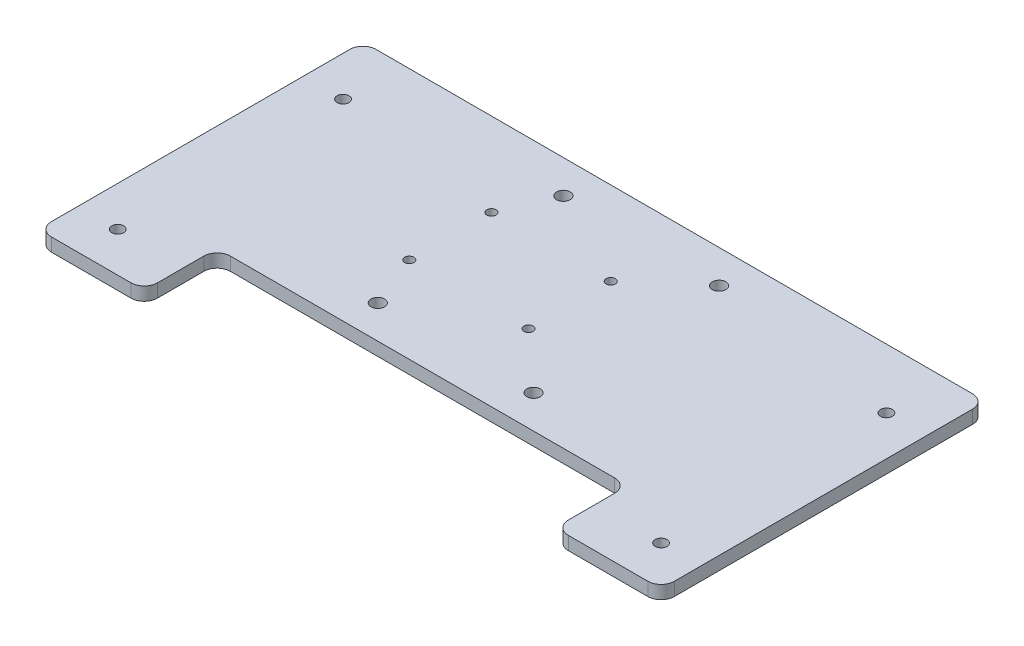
ISO-10303-21;
HEADER;
FILE_DESCRIPTION(('STEP AP214'),'2;1');
FILE_NAME('part.step','',(''),(''),'','','');
FILE_SCHEMA(('AUTOMOTIVE_DESIGN { 1 0 10303 214 1 1 1 1 }'));
ENDSEC;
DATA;
#1=APPLICATION_CONTEXT('core data for automotive mechanical design processes');
#2=APPLICATION_PROTOCOL_DEFINITION('international standard','automotive_design',2000,#1);
#3=PRODUCT_CONTEXT('',#1,'mechanical');
#4=PRODUCT('Part','Part','',(#3));
#5=PRODUCT_RELATED_PRODUCT_CATEGORY('part','',(#4));
#6=PRODUCT_DEFINITION_FORMATION('','',#4);
#7=PRODUCT_DEFINITION_CONTEXT('part definition',#1,'design');
#8=PRODUCT_DEFINITION('design','',#6,#7);
#9=PRODUCT_DEFINITION_SHAPE('','',#8);
#10=(LENGTH_UNIT() NAMED_UNIT(*) SI_UNIT(.MILLI.,.METRE.));
#11=(NAMED_UNIT(*) PLANE_ANGLE_UNIT() SI_UNIT($,.RADIAN.));
#12=(NAMED_UNIT(*) SI_UNIT($,.STERADIAN.) SOLID_ANGLE_UNIT());
#13=UNCERTAINTY_MEASURE_WITH_UNIT(LENGTH_MEASURE(1.E-05),#10,'distance_accuracy_value','');
#14=(GEOMETRIC_REPRESENTATION_CONTEXT(3) GLOBAL_UNCERTAINTY_ASSIGNED_CONTEXT((#13)) GLOBAL_UNIT_ASSIGNED_CONTEXT((#10,
#11,#12)) REPRESENTATION_CONTEXT('',''));
#15=CARTESIAN_POINT('',(0.,0.,0.));
#16=DIRECTION('',(0.,0.,1.));
#17=DIRECTION('',(1.,0.,0.));
#18=AXIS2_PLACEMENT_3D('',#15,#16,#17);
#19=CARTESIAN_POINT('',(145.,10.,-45.));
#20=DIRECTION('',(0.,1.,0.));
#21=DIRECTION('',(0.,0.,1.));
#22=AXIS2_PLACEMENT_3D('',#19,#20,#21);
#23=PLANE('',#22);
#24=CARTESIAN_POINT('',(58.75,10.,-220.));
#25=DIRECTION('',(0.,1.,0.));
#26=DIRECTION('',(0.,0.,1.));
#27=AXIS2_PLACEMENT_3D('',#24,#25,#26);
#28=CIRCLE('',#27,5.12500000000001);
#29=CARTESIAN_POINT('',(58.75,10.,-214.875));
#30=VERTEX_POINT('',#29);
#31=EDGE_CURVE('E403',#30,#30,#28,.T.);
#32=ORIENTED_EDGE('',*,*,#31,.F.);
#33=EDGE_LOOP('',(#32));
#34=FACE_BOUND('',#33,.T.);
#35=CARTESIAN_POINT('',(-58.75,10.,-220.));
#36=DIRECTION('',(0.,1.,0.));
#37=DIRECTION('',(0.,0.,1.));
#38=AXIS2_PLACEMENT_3D('',#35,#36,#37);
#39=CIRCLE('',#38,5.12500000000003);
#40=CARTESIAN_POINT('',(-58.75,10.,-214.875));
#41=VERTEX_POINT('',#40);
#42=EDGE_CURVE('E405',#41,#41,#39,.T.);
#43=ORIENTED_EDGE('',*,*,#42,.F.);
#44=EDGE_LOOP('',(#43));
#45=FACE_BOUND('',#44,.T.);
#46=CARTESIAN_POINT('',(58.75,10.,-80.));
#47=DIRECTION('',(0.,1.,0.));
#48=DIRECTION('',(0.,0.,1.));
#49=AXIS2_PLACEMENT_3D('',#46,#47,#48);
#50=CIRCLE('',#49,5.12500000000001);
#51=CARTESIAN_POINT('',(58.75,10.,-74.875));
#52=VERTEX_POINT('',#51);
#53=EDGE_CURVE('E413',#52,#52,#50,.T.);
#54=ORIENTED_EDGE('',*,*,#53,.F.);
#55=EDGE_LOOP('',(#54));
#56=FACE_BOUND('',#55,.T.);
#57=CARTESIAN_POINT('',(-58.75,10.,-80.));
#58=DIRECTION('',(0.,1.,0.));
#59=DIRECTION('',(0.,0.,1.));
#60=AXIS2_PLACEMENT_3D('',#57,#58,#59);
#61=CIRCLE('',#60,5.125);
#62=CARTESIAN_POINT('',(-58.75,10.,-74.875));
#63=VERTEX_POINT('',#62);
#64=EDGE_CURVE('E419',#63,#63,#61,.T.);
#65=ORIENTED_EDGE('',*,*,#64,.F.);
#66=EDGE_LOOP('',(#65));
#67=FACE_BOUND('',#66,.T.);
#68=CARTESIAN_POINT('',(15.,10.,-182.));
#69=DIRECTION('',(0.,1.,0.));
#70=DIRECTION('',(0.,0.,1.));
#71=AXIS2_PLACEMENT_3D('',#68,#69,#70);
#72=CIRCLE('',#71,3.5);
#73=CARTESIAN_POINT('',(15.,10.,-178.5));
#74=VERTEX_POINT('',#73);
#75=EDGE_CURVE('E434',#74,#74,#72,.T.);
#76=ORIENTED_EDGE('',*,*,#75,.F.);
#77=EDGE_LOOP('',(#76));
#78=FACE_BOUND('',#77,.T.);
#79=CARTESIAN_POINT('',(-75.,10.,-182.));
#80=DIRECTION('',(0.,1.,0.));
#81=DIRECTION('',(0.,0.,1.));
#82=AXIS2_PLACEMENT_3D('',#79,#80,#81);
#83=CIRCLE('',#82,3.50000000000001);
#84=CARTESIAN_POINT('',(-75.,10.,-178.5));
#85=VERTEX_POINT('',#84);
#86=EDGE_CURVE('E446',#85,#85,#83,.T.);
#87=ORIENTED_EDGE('',*,*,#86,.F.);
#88=EDGE_LOOP('',(#87));
#89=FACE_BOUND('',#88,.T.);
#90=CARTESIAN_POINT('',(-205.,10.,-30.));
#91=DIRECTION('',(0.,1.,0.));
#92=DIRECTION('',(0.,0.,-1.));
#93=AXIS2_PLACEMENT_3D('',#90,#91,#92);
#94=CIRCLE('',#93,4.49999999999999);
#95=CARTESIAN_POINT('',(-205.,10.,-34.5));
#96=VERTEX_POINT('',#95);
#97=EDGE_CURVE('E458',#96,#96,#94,.T.);
#98=ORIENTED_EDGE('',*,*,#97,.F.);
#99=EDGE_LOOP('',(#98));
#100=FACE_BOUND('',#99,.T.);
#101=CARTESIAN_POINT('',(205.,10.,-200.));
#102=DIRECTION('',(0.,1.,0.));
#103=DIRECTION('',(0.,0.,1.));
#104=AXIS2_PLACEMENT_3D('',#101,#102,#103);
#105=CIRCLE('',#104,4.49999999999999);
#106=CARTESIAN_POINT('',(205.,10.,-195.5));
#107=VERTEX_POINT('',#106);
#108=EDGE_CURVE('E166',#107,#107,#105,.T.);
#109=ORIENTED_EDGE('',*,*,#108,.F.);
#110=EDGE_LOOP('',(#109));
#111=FACE_BOUND('',#110,.T.);
#112=CARTESIAN_POINT('',(145.,10.,-45.));
#113=DIRECTION('',(0.,-1.,0.));
#114=DIRECTION('',(0.,0.,1.));
#115=AXIS2_PLACEMENT_3D('',#112,#113,#114);
#116=CIRCLE('',#115,10.);
#117=CARTESIAN_POINT('',(145.,10.,-55.));
#118=VERTEX_POINT('',#117);
#119=CARTESIAN_POINT('',(155.,10.,-44.9999999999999));
#120=VERTEX_POINT('',#119);
#121=EDGE_CURVE('E200',#118,#120,#116,.T.);
#122=ORIENTED_EDGE('',*,*,#121,.T.);
#123=DIRECTION('',(0.,0.,1.));
#124=VECTOR('',#123,1.);
#125=CARTESIAN_POINT('',(155.,10.,-44.9999999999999));
#126=LINE('',#125,#124);
#127=CARTESIAN_POINT('',(155.,10.,-10.0000000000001));
#128=VERTEX_POINT('',#127);
#129=EDGE_CURVE('E161',#120,#128,#126,.T.);
#130=ORIENTED_EDGE('',*,*,#129,.T.);
#131=CARTESIAN_POINT('',(165.,10.,-10.));
#132=DIRECTION('',(0.,1.,0.));
#133=DIRECTION('',(0.,0.,-1.));
#134=AXIS2_PLACEMENT_3D('',#131,#132,#133);
#135=CIRCLE('',#134,10.);
#136=CARTESIAN_POINT('',(165.,10.,0.));
#137=VERTEX_POINT('',#136);
#138=EDGE_CURVE('E203',#128,#137,#135,.T.);
#139=ORIENTED_EDGE('',*,*,#138,.T.);
#140=DIRECTION('',(1.,0.,0.));
#141=VECTOR('',#140,1.);
#142=CARTESIAN_POINT('',(165.,10.,0.));
#143=LINE('',#142,#141);
#144=CARTESIAN_POINT('',(225.,10.,0.));
#145=VERTEX_POINT('',#144);
#146=EDGE_CURVE('E205',#137,#145,#143,.T.);
#147=ORIENTED_EDGE('',*,*,#146,.T.);
#148=CARTESIAN_POINT('',(225.,10.,-10.));
#149=DIRECTION('',(0.,1.,0.));
#150=DIRECTION('',(0.,0.,-1.));
#151=AXIS2_PLACEMENT_3D('',#148,#149,#150);
#152=CIRCLE('',#151,10.);
#153=CARTESIAN_POINT('',(235.,10.,-10.0000000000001));
#154=VERTEX_POINT('',#153);
#155=EDGE_CURVE('E207',#145,#154,#152,.T.);
#156=ORIENTED_EDGE('',*,*,#155,.T.);
#157=DIRECTION('',(0.,0.,-1.));
#158=VECTOR('',#157,1.);
#159=CARTESIAN_POINT('',(235.,10.,-10.0000000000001));
#160=LINE('',#159,#158);
#161=CARTESIAN_POINT('',(235.,10.,-235.));
#162=VERTEX_POINT('',#161);
#163=EDGE_CURVE('E209',#154,#162,#160,.T.);
#164=ORIENTED_EDGE('',*,*,#163,.T.);
#165=CARTESIAN_POINT('',(225.,10.,-235.));
#166=DIRECTION('',(0.,1.,0.));
#167=DIRECTION('',(0.,0.,-1.));
#168=AXIS2_PLACEMENT_3D('',#165,#166,#167);
#169=CIRCLE('',#168,10.);
#170=CARTESIAN_POINT('',(225.,10.,-245.));
#171=VERTEX_POINT('',#170);
#172=EDGE_CURVE('E211',#162,#171,#169,.T.);
#173=ORIENTED_EDGE('',*,*,#172,.T.);
#174=DIRECTION('',(-1.,0.,0.));
#175=VECTOR('',#174,1.);
#176=CARTESIAN_POINT('',(-225.,10.,-245.));
#177=LINE('',#176,#175);
#178=CARTESIAN_POINT('',(-225.,10.,-245.));
#179=VERTEX_POINT('',#178);
#180=EDGE_CURVE('E213',#171,#179,#177,.T.);
#181=ORIENTED_EDGE('',*,*,#180,.T.);
#182=CARTESIAN_POINT('',(-225.,10.,-235.));
#183=DIRECTION('',(0.,1.,0.));
#184=DIRECTION('',(0.,0.,1.));
#185=AXIS2_PLACEMENT_3D('',#182,#183,#184);
#186=CIRCLE('',#185,10.);
#187=CARTESIAN_POINT('',(-235.,10.,-235.));
#188=VERTEX_POINT('',#187);
#189=EDGE_CURVE('E215',#179,#188,#186,.T.);
#190=ORIENTED_EDGE('',*,*,#189,.T.);
#191=DIRECTION('',(0.,0.,1.));
#192=VECTOR('',#191,1.);
#193=CARTESIAN_POINT('',(-235.,10.,-10.0000000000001));
#194=LINE('',#193,#192);
#195=CARTESIAN_POINT('',(-235.,10.,-10.0000000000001));
#196=VERTEX_POINT('',#195);
#197=EDGE_CURVE('E217',#188,#196,#194,.T.);
#198=ORIENTED_EDGE('',*,*,#197,.T.);
#199=CARTESIAN_POINT('',(-225.,10.,-10.));
#200=DIRECTION('',(0.,1.,0.));
#201=DIRECTION('',(0.,0.,1.));
#202=AXIS2_PLACEMENT_3D('',#199,#200,#201);
#203=CIRCLE('',#202,10.);
#204=CARTESIAN_POINT('',(-225.,10.,0.));
#205=VERTEX_POINT('',#204);
#206=EDGE_CURVE('E219',#196,#205,#203,.T.);
#207=ORIENTED_EDGE('',*,*,#206,.T.);
#208=DIRECTION('',(1.,0.,0.));
#209=VECTOR('',#208,1.);
#210=CARTESIAN_POINT('',(-165.,10.,0.));
#211=LINE('',#210,#209);
#212=CARTESIAN_POINT('',(-165.,10.,0.));
#213=VERTEX_POINT('',#212);
#214=EDGE_CURVE('E221',#205,#213,#211,.T.);
#215=ORIENTED_EDGE('',*,*,#214,.T.);
#216=CARTESIAN_POINT('',(-165.,10.,-10.));
#217=DIRECTION('',(0.,1.,0.));
#218=DIRECTION('',(0.,0.,1.));
#219=AXIS2_PLACEMENT_3D('',#216,#217,#218);
#220=CIRCLE('',#219,10.);
#221=CARTESIAN_POINT('',(-155.,10.,-10.0000000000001));
#222=VERTEX_POINT('',#221);
#223=EDGE_CURVE('E223',#213,#222,#220,.T.);
#224=ORIENTED_EDGE('',*,*,#223,.T.);
#225=DIRECTION('',(0.,0.,-1.));
#226=VECTOR('',#225,1.);
#227=CARTESIAN_POINT('',(-155.,10.,-44.9999999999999));
#228=LINE('',#227,#226);
#229=CARTESIAN_POINT('',(-155.,10.,-44.9999999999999));
#230=VERTEX_POINT('',#229);
#231=EDGE_CURVE('E225',#222,#230,#228,.T.);
#232=ORIENTED_EDGE('',*,*,#231,.T.);
#233=CARTESIAN_POINT('',(-145.,10.,-45.));
#234=DIRECTION('',(0.,-1.,0.));
#235=DIRECTION('',(0.,0.,-1.));
#236=AXIS2_PLACEMENT_3D('',#233,#234,#235);
#237=CIRCLE('',#236,10.);
#238=CARTESIAN_POINT('',(-145.,10.,-55.));
#239=VERTEX_POINT('',#238);
#240=EDGE_CURVE('E54',#230,#239,#237,.T.);
#241=ORIENTED_EDGE('',*,*,#240,.T.);
#242=DIRECTION('',(1.,0.,0.));
#243=VECTOR('',#242,1.);
#244=CARTESIAN_POINT('',(-145.,10.,-55.));
#245=LINE('',#244,#243);
#246=EDGE_CURVE('E49',#239,#118,#245,.T.);
#247=ORIENTED_EDGE('',*,*,#246,.T.);
#248=EDGE_LOOP('',(#122,#130,#139,#147,#156,#164,#173,#181,#190,#198,#207,#215,#224,#232,#241,#247));
#249=FACE_BOUND('',#248,.T.);
#250=CARTESIAN_POINT('',(205.,10.,-30.));
#251=DIRECTION('',(0.,1.,0.));
#252=DIRECTION('',(0.,0.,1.));
#253=AXIS2_PLACEMENT_3D('',#250,#251,#252);
#254=CIRCLE('',#253,4.49999999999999);
#255=CARTESIAN_POINT('',(205.,10.,-25.5));
#256=VERTEX_POINT('',#255);
#257=EDGE_CURVE('E464',#256,#256,#254,.T.);
#258=ORIENTED_EDGE('',*,*,#257,.F.);
#259=EDGE_LOOP('',(#258));
#260=FACE_BOUND('',#259,.T.);
#261=CARTESIAN_POINT('',(-205.,10.,-200.));
#262=DIRECTION('',(0.,1.,0.));
#263=DIRECTION('',(0.,0.,-1.));
#264=AXIS2_PLACEMENT_3D('',#261,#262,#263);
#265=CIRCLE('',#264,4.49999999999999);
#266=CARTESIAN_POINT('',(-205.,10.,-204.5));
#267=VERTEX_POINT('',#266);
#268=EDGE_CURVE('E452',#267,#267,#265,.T.);
#269=ORIENTED_EDGE('',*,*,#268,.F.);
#270=EDGE_LOOP('',(#269));
#271=FACE_BOUND('',#270,.T.);
#272=CARTESIAN_POINT('',(-75.,10.,-120.));
#273=DIRECTION('',(0.,1.,0.));
#274=DIRECTION('',(0.,0.,1.));
#275=AXIS2_PLACEMENT_3D('',#272,#273,#274);
#276=CIRCLE('',#275,3.50000000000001);
#277=CARTESIAN_POINT('',(-75.,10.,-116.5));
#278=VERTEX_POINT('',#277);
#279=EDGE_CURVE('E440',#278,#278,#276,.T.);
#280=ORIENTED_EDGE('',*,*,#279,.F.);
#281=EDGE_LOOP('',(#280));
#282=FACE_BOUND('',#281,.T.);
#283=CARTESIAN_POINT('',(15.,10.,-120.));
#284=DIRECTION('',(0.,1.,0.));
#285=DIRECTION('',(0.,0.,1.));
#286=AXIS2_PLACEMENT_3D('',#283,#284,#285);
#287=CIRCLE('',#286,3.5);
#288=CARTESIAN_POINT('',(15.,10.,-116.5));
#289=VERTEX_POINT('',#288);
#290=EDGE_CURVE('E428',#289,#289,#287,.T.);
#291=ORIENTED_EDGE('',*,*,#290,.F.);
#292=EDGE_LOOP('',(#291));
#293=FACE_BOUND('',#292,.T.);
#294=ADVANCED_FACE('F34',(#34,#45,#56,#67,#78,#89,#100,#111,#249,#260,#271,#282,#293),#23,.T.);
#295=CARTESIAN_POINT('',(145.,0.,-45.));
#296=DIRECTION('',(0.,1.,0.));
#297=DIRECTION('',(0.,0.,1.));
#298=AXIS2_PLACEMENT_3D('',#295,#296,#297);
#299=PLANE('',#298);
#300=CARTESIAN_POINT('',(58.75,0.,-220.));
#301=DIRECTION('',(0.,1.,0.));
#302=DIRECTION('',(0.,0.,1.));
#303=AXIS2_PLACEMENT_3D('',#300,#301,#302);
#304=CIRCLE('',#303,5.12500000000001);
#305=CARTESIAN_POINT('',(58.75,0.,-214.875));
#306=VERTEX_POINT('',#305);
#307=EDGE_CURVE('E401',#306,#306,#304,.T.);
#308=ORIENTED_EDGE('',*,*,#307,.T.);
#309=EDGE_LOOP('',(#308));
#310=FACE_BOUND('',#309,.T.);
#311=CARTESIAN_POINT('',(-58.75,0.,-220.));
#312=DIRECTION('',(0.,1.,0.));
#313=DIRECTION('',(0.,0.,1.));
#314=AXIS2_PLACEMENT_3D('',#311,#312,#313);
#315=CIRCLE('',#314,5.12500000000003);
#316=CARTESIAN_POINT('',(-58.75,0.,-214.875));
#317=VERTEX_POINT('',#316);
#318=EDGE_CURVE('E410',#317,#317,#315,.T.);
#319=ORIENTED_EDGE('',*,*,#318,.T.);
#320=EDGE_LOOP('',(#319));
#321=FACE_BOUND('',#320,.T.);
#322=CARTESIAN_POINT('',(58.75,0.,-80.));
#323=DIRECTION('',(0.,1.,0.));
#324=DIRECTION('',(0.,0.,1.));
#325=AXIS2_PLACEMENT_3D('',#322,#323,#324);
#326=CIRCLE('',#325,5.12500000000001);
#327=CARTESIAN_POINT('',(58.75,0.,-74.875));
#328=VERTEX_POINT('',#327);
#329=EDGE_CURVE('E416',#328,#328,#326,.T.);
#330=ORIENTED_EDGE('',*,*,#329,.T.);
#331=EDGE_LOOP('',(#330));
#332=FACE_BOUND('',#331,.T.);
#333=CARTESIAN_POINT('',(-58.75,0.,-80.));
#334=DIRECTION('',(0.,1.,0.));
#335=DIRECTION('',(0.,0.,1.));
#336=AXIS2_PLACEMENT_3D('',#333,#334,#335);
#337=CIRCLE('',#336,5.125);
#338=CARTESIAN_POINT('',(-58.75,0.,-74.875));
#339=VERTEX_POINT('',#338);
#340=EDGE_CURVE('E422',#339,#339,#337,.T.);
#341=ORIENTED_EDGE('',*,*,#340,.T.);
#342=EDGE_LOOP('',(#341));
#343=FACE_BOUND('',#342,.T.);
#344=CARTESIAN_POINT('',(15.,0.,-182.));
#345=DIRECTION('',(0.,1.,0.));
#346=DIRECTION('',(0.,0.,1.));
#347=AXIS2_PLACEMENT_3D('',#344,#345,#346);
#348=CIRCLE('',#347,3.5);
#349=CARTESIAN_POINT('',(15.,0.,-178.5));
#350=VERTEX_POINT('',#349);
#351=EDGE_CURVE('E431',#350,#350,#348,.T.);
#352=ORIENTED_EDGE('',*,*,#351,.T.);
#353=EDGE_LOOP('',(#352));
#354=FACE_BOUND('',#353,.T.);
#355=CARTESIAN_POINT('',(-75.,0.,-182.));
#356=DIRECTION('',(0.,1.,0.));
#357=DIRECTION('',(0.,0.,1.));
#358=AXIS2_PLACEMENT_3D('',#355,#356,#357);
#359=CIRCLE('',#358,3.50000000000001);
#360=CARTESIAN_POINT('',(-75.,0.,-178.5));
#361=VERTEX_POINT('',#360);
#362=EDGE_CURVE('E443',#361,#361,#359,.T.);
#363=ORIENTED_EDGE('',*,*,#362,.T.);
#364=EDGE_LOOP('',(#363));
#365=FACE_BOUND('',#364,.T.);
#366=CARTESIAN_POINT('',(-205.,0.,-30.));
#367=DIRECTION('',(0.,1.,0.));
#368=DIRECTION('',(0.,0.,-1.));
#369=AXIS2_PLACEMENT_3D('',#366,#367,#368);
#370=CIRCLE('',#369,4.49999999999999);
#371=CARTESIAN_POINT('',(-205.,0.,-34.5));
#372=VERTEX_POINT('',#371);
#373=EDGE_CURVE('E455',#372,#372,#370,.T.);
#374=ORIENTED_EDGE('',*,*,#373,.T.);
#375=EDGE_LOOP('',(#374));
#376=FACE_BOUND('',#375,.T.);
#377=CARTESIAN_POINT('',(205.,0.,-200.));
#378=DIRECTION('',(0.,1.,0.));
#379=DIRECTION('',(0.,0.,1.));
#380=AXIS2_PLACEMENT_3D('',#377,#378,#379);
#381=CIRCLE('',#380,4.49999999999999);
#382=CARTESIAN_POINT('',(205.,0.,-195.5));
#383=VERTEX_POINT('',#382);
#384=EDGE_CURVE('E169',#383,#383,#381,.T.);
#385=ORIENTED_EDGE('',*,*,#384,.T.);
#386=EDGE_LOOP('',(#385));
#387=FACE_BOUND('',#386,.T.);
#388=CARTESIAN_POINT('',(145.,0.,-45.));
#389=DIRECTION('',(0.,-1.,0.));
#390=DIRECTION('',(0.,0.,1.));
#391=AXIS2_PLACEMENT_3D('',#388,#389,#390);
#392=CIRCLE('',#391,10.);
#393=CARTESIAN_POINT('',(145.,0.,-55.));
#394=VERTEX_POINT('',#393);
#395=CARTESIAN_POINT('',(155.,0.,-44.9999999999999));
#396=VERTEX_POINT('',#395);
#397=EDGE_CURVE('E152',#394,#396,#392,.T.);
#398=ORIENTED_EDGE('',*,*,#397,.F.);
#399=DIRECTION('',(1.,0.,0.));
#400=VECTOR('',#399,1.);
#401=CARTESIAN_POINT('',(-145.,0.,-55.));
#402=LINE('',#401,#400);
#403=CARTESIAN_POINT('',(-145.,0.,-55.));
#404=VERTEX_POINT('',#403);
#405=EDGE_CURVE('E198',#404,#394,#402,.T.);
#406=ORIENTED_EDGE('',*,*,#405,.F.);
#407=CARTESIAN_POINT('',(-145.,0.,-45.));
#408=DIRECTION('',(0.,-1.,0.));
#409=DIRECTION('',(0.,0.,-1.));
#410=AXIS2_PLACEMENT_3D('',#407,#408,#409);
#411=CIRCLE('',#410,10.);
#412=CARTESIAN_POINT('',(-155.,0.,-44.9999999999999));
#413=VERTEX_POINT('',#412);
#414=EDGE_CURVE('E196',#413,#404,#411,.T.);
#415=ORIENTED_EDGE('',*,*,#414,.F.);
#416=DIRECTION('',(0.,0.,-1.));
#417=VECTOR('',#416,1.);
#418=CARTESIAN_POINT('',(-155.,0.,-44.9999999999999));
#419=LINE('',#418,#417);
#420=CARTESIAN_POINT('',(-155.,0.,-10.0000000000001));
#421=VERTEX_POINT('',#420);
#422=EDGE_CURVE('E194',#421,#413,#419,.T.);
#423=ORIENTED_EDGE('',*,*,#422,.F.);
#424=CARTESIAN_POINT('',(-165.,0.,-10.));
#425=DIRECTION('',(0.,1.,0.));
#426=DIRECTION('',(0.,0.,1.));
#427=AXIS2_PLACEMENT_3D('',#424,#425,#426);
#428=CIRCLE('',#427,10.);
#429=CARTESIAN_POINT('',(-165.,0.,0.));
#430=VERTEX_POINT('',#429);
#431=EDGE_CURVE('E192',#430,#421,#428,.T.);
#432=ORIENTED_EDGE('',*,*,#431,.F.);
#433=DIRECTION('',(1.,0.,0.));
#434=VECTOR('',#433,1.);
#435=CARTESIAN_POINT('',(-165.,0.,0.));
#436=LINE('',#435,#434);
#437=CARTESIAN_POINT('',(-225.,0.,0.));
#438=VERTEX_POINT('',#437);
#439=EDGE_CURVE('E190',#438,#430,#436,.T.);
#440=ORIENTED_EDGE('',*,*,#439,.F.);
#441=CARTESIAN_POINT('',(-225.,0.,-10.));
#442=DIRECTION('',(0.,1.,0.));
#443=DIRECTION('',(0.,0.,1.));
#444=AXIS2_PLACEMENT_3D('',#441,#442,#443);
#445=CIRCLE('',#444,10.);
#446=CARTESIAN_POINT('',(-235.,0.,-10.0000000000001));
#447=VERTEX_POINT('',#446);
#448=EDGE_CURVE('E188',#447,#438,#445,.T.);
#449=ORIENTED_EDGE('',*,*,#448,.F.);
#450=DIRECTION('',(0.,0.,1.));
#451=VECTOR('',#450,1.);
#452=CARTESIAN_POINT('',(-235.,0.,-10.0000000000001));
#453=LINE('',#452,#451);
#454=CARTESIAN_POINT('',(-235.,0.,-235.));
#455=VERTEX_POINT('',#454);
#456=EDGE_CURVE('E186',#455,#447,#453,.T.);
#457=ORIENTED_EDGE('',*,*,#456,.F.);
#458=CARTESIAN_POINT('',(-225.,0.,-235.));
#459=DIRECTION('',(0.,1.,0.));
#460=DIRECTION('',(0.,0.,1.));
#461=AXIS2_PLACEMENT_3D('',#458,#459,#460);
#462=CIRCLE('',#461,10.);
#463=CARTESIAN_POINT('',(-225.,0.,-245.));
#464=VERTEX_POINT('',#463);
#465=EDGE_CURVE('E184',#464,#455,#462,.T.);
#466=ORIENTED_EDGE('',*,*,#465,.F.);
#467=DIRECTION('',(-1.,0.,0.));
#468=VECTOR('',#467,1.);
#469=CARTESIAN_POINT('',(-225.,0.,-245.));
#470=LINE('',#469,#468);
#471=CARTESIAN_POINT('',(225.,0.,-245.));
#472=VERTEX_POINT('',#471);
#473=EDGE_CURVE('E182',#472,#464,#470,.T.);
#474=ORIENTED_EDGE('',*,*,#473,.F.);
#475=CARTESIAN_POINT('',(225.,0.,-235.));
#476=DIRECTION('',(0.,1.,0.));
#477=DIRECTION('',(0.,0.,-1.));
#478=AXIS2_PLACEMENT_3D('',#475,#476,#477);
#479=CIRCLE('',#478,10.);
#480=CARTESIAN_POINT('',(235.,0.,-235.));
#481=VERTEX_POINT('',#480);
#482=EDGE_CURVE('E180',#481,#472,#479,.T.);
#483=ORIENTED_EDGE('',*,*,#482,.F.);
#484=DIRECTION('',(0.,0.,-1.));
#485=VECTOR('',#484,1.);
#486=CARTESIAN_POINT('',(235.,0.,-10.0000000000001));
#487=LINE('',#486,#485);
#488=CARTESIAN_POINT('',(235.,0.,-10.0000000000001));
#489=VERTEX_POINT('',#488);
#490=EDGE_CURVE('E178',#489,#481,#487,.T.);
#491=ORIENTED_EDGE('',*,*,#490,.F.);
#492=CARTESIAN_POINT('',(225.,0.,-10.));
#493=DIRECTION('',(0.,1.,0.));
#494=DIRECTION('',(0.,0.,-1.));
#495=AXIS2_PLACEMENT_3D('',#492,#493,#494);
#496=CIRCLE('',#495,10.);
#497=CARTESIAN_POINT('',(225.,0.,0.));
#498=VERTEX_POINT('',#497);
#499=EDGE_CURVE('E176',#498,#489,#496,.T.);
#500=ORIENTED_EDGE('',*,*,#499,.F.);
#501=DIRECTION('',(1.,0.,0.));
#502=VECTOR('',#501,1.);
#503=CARTESIAN_POINT('',(165.,0.,0.));
#504=LINE('',#503,#502);
#505=CARTESIAN_POINT('',(165.,0.,0.));
#506=VERTEX_POINT('',#505);
#507=EDGE_CURVE('E174',#506,#498,#504,.T.);
#508=ORIENTED_EDGE('',*,*,#507,.F.);
#509=CARTESIAN_POINT('',(165.,0.,-10.));
#510=DIRECTION('',(0.,1.,0.));
#511=DIRECTION('',(0.,0.,-1.));
#512=AXIS2_PLACEMENT_3D('',#509,#510,#511);
#513=CIRCLE('',#512,10.);
#514=CARTESIAN_POINT('',(155.,0.,-10.0000000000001));
#515=VERTEX_POINT('',#514);
#516=EDGE_CURVE('E154',#515,#506,#513,.T.);
#517=ORIENTED_EDGE('',*,*,#516,.F.);
#518=DIRECTION('',(0.,0.,1.));
#519=VECTOR('',#518,1.);
#520=CARTESIAN_POINT('',(155.,0.,-44.9999999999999));
#521=LINE('',#520,#519);
#522=EDGE_CURVE('E147',#396,#515,#521,.T.);
#523=ORIENTED_EDGE('',*,*,#522,.F.);
#524=EDGE_LOOP('',(#398,#406,#415,#423,#432,#440,#449,#457,#466,#474,#483,#491,#500,#508,#517,#523));
#525=FACE_BOUND('',#524,.T.);
#526=CARTESIAN_POINT('',(205.,0.,-30.));
#527=DIRECTION('',(0.,1.,0.));
#528=DIRECTION('',(0.,0.,1.));
#529=AXIS2_PLACEMENT_3D('',#526,#527,#528);
#530=CIRCLE('',#529,4.49999999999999);
#531=CARTESIAN_POINT('',(205.,0.,-25.5));
#532=VERTEX_POINT('',#531);
#533=EDGE_CURVE('E461',#532,#532,#530,.T.);
#534=ORIENTED_EDGE('',*,*,#533,.T.);
#535=EDGE_LOOP('',(#534));
#536=FACE_BOUND('',#535,.T.);
#537=CARTESIAN_POINT('',(-205.,0.,-200.));
#538=DIRECTION('',(0.,1.,0.));
#539=DIRECTION('',(0.,0.,-1.));
#540=AXIS2_PLACEMENT_3D('',#537,#538,#539);
#541=CIRCLE('',#540,4.49999999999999);
#542=CARTESIAN_POINT('',(-205.,0.,-204.5));
#543=VERTEX_POINT('',#542);
#544=EDGE_CURVE('E449',#543,#543,#541,.T.);
#545=ORIENTED_EDGE('',*,*,#544,.T.);
#546=EDGE_LOOP('',(#545));
#547=FACE_BOUND('',#546,.T.);
#548=CARTESIAN_POINT('',(-75.,0.,-120.));
#549=DIRECTION('',(0.,1.,0.));
#550=DIRECTION('',(0.,0.,1.));
#551=AXIS2_PLACEMENT_3D('',#548,#549,#550);
#552=CIRCLE('',#551,3.50000000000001);
#553=CARTESIAN_POINT('',(-75.,0.,-116.5));
#554=VERTEX_POINT('',#553);
#555=EDGE_CURVE('E437',#554,#554,#552,.T.);
#556=ORIENTED_EDGE('',*,*,#555,.T.);
#557=EDGE_LOOP('',(#556));
#558=FACE_BOUND('',#557,.T.);
#559=CARTESIAN_POINT('',(15.,0.,-120.));
#560=DIRECTION('',(0.,1.,0.));
#561=DIRECTION('',(0.,0.,1.));
#562=AXIS2_PLACEMENT_3D('',#559,#560,#561);
#563=CIRCLE('',#562,3.5);
#564=CARTESIAN_POINT('',(15.,0.,-116.5));
#565=VERTEX_POINT('',#564);
#566=EDGE_CURVE('E425',#565,#565,#563,.T.);
#567=ORIENTED_EDGE('',*,*,#566,.T.);
#568=EDGE_LOOP('',(#567));
#569=FACE_BOUND('',#568,.T.);
#570=ADVANCED_FACE('F148',(#310,#321,#332,#343,#354,#365,#376,#387,#525,#536,#547,#558,#569),
#299,.F.);
#571=CARTESIAN_POINT('',(145.,10.,-45.));
#572=DIRECTION('',(0.,-1.,0.));
#573=DIRECTION('',(0.,0.,-1.));
#574=AXIS2_PLACEMENT_3D('',#571,#572,#573);
#575=CYLINDRICAL_SURFACE('',#574,10.);
#576=ORIENTED_EDGE('',*,*,#397,.T.);
#577=DIRECTION('',(0.,-1.,0.));
#578=VECTOR('',#577,1.);
#579=CARTESIAN_POINT('',(155.,10.,-44.9999999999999));
#580=LINE('',#579,#578);
#581=EDGE_CURVE('E11',#120,#396,#580,.T.);
#582=ORIENTED_EDGE('',*,*,#581,.F.);
#583=ORIENTED_EDGE('',*,*,#121,.F.);
#584=DIRECTION('',(0.,-1.,0.));
#585=VECTOR('',#584,1.);
#586=CARTESIAN_POINT('',(145.,10.,-55.));
#587=LINE('',#586,#585);
#588=EDGE_CURVE('E165',#118,#394,#587,.T.);
#589=ORIENTED_EDGE('',*,*,#588,.T.);
#590=EDGE_LOOP('',(#576,#582,#583,#589));
#591=FACE_BOUND('',#590,.T.);
#592=ADVANCED_FACE('F36',(#591),#575,.F.);
#593=CARTESIAN_POINT('',(155.,10.,-44.9999999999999));
#594=DIRECTION('',(1.,0.,0.));
#595=DIRECTION('',(0.,0.,-1.));
#596=AXIS2_PLACEMENT_3D('',#593,#594,#595);
#597=PLANE('',#596);
#598=ORIENTED_EDGE('',*,*,#522,.T.);
#599=DIRECTION('',(0.,-1.,0.));
#600=VECTOR('',#599,1.);
#601=CARTESIAN_POINT('',(155.,10.,-10.0000000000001));
#602=LINE('',#601,#600);
#603=EDGE_CURVE('E42',#128,#515,#602,.T.);
#604=ORIENTED_EDGE('',*,*,#603,.F.);
#605=ORIENTED_EDGE('',*,*,#129,.F.);
#606=ORIENTED_EDGE('',*,*,#581,.T.);
#607=EDGE_LOOP('',(#598,#604,#605,#606));
#608=FACE_BOUND('',#607,.T.);
#609=ADVANCED_FACE('F160',(#608),#597,.F.);
#610=CARTESIAN_POINT('',(165.,10.,-10.));
#611=DIRECTION('',(0.,-1.,0.));
#612=DIRECTION('',(0.,0.,-1.));
#613=AXIS2_PLACEMENT_3D('',#610,#611,#612);
#614=CYLINDRICAL_SURFACE('',#613,10.);
#615=ORIENTED_EDGE('',*,*,#516,.T.);
#616=DIRECTION('',(0.,-1.,0.));
#617=VECTOR('',#616,1.);
#618=CARTESIAN_POINT('',(165.,10.,0.));
#619=LINE('',#618,#617);
#620=EDGE_CURVE('E266',#137,#506,#619,.T.);
#621=ORIENTED_EDGE('',*,*,#620,.F.);
#622=ORIENTED_EDGE('',*,*,#138,.F.);
#623=ORIENTED_EDGE('',*,*,#603,.T.);
#624=EDGE_LOOP('',(#615,#621,#622,#623));
#625=FACE_BOUND('',#624,.T.);
#626=ADVANCED_FACE('F270',(#625),#614,.T.);
#627=CARTESIAN_POINT('',(165.,10.,0.));
#628=DIRECTION('',(0.,0.,-1.));
#629=DIRECTION('',(-1.,0.,0.));
#630=AXIS2_PLACEMENT_3D('',#627,#628,#629);
#631=PLANE('',#630);
#632=ORIENTED_EDGE('',*,*,#507,.T.);
#633=DIRECTION('',(0.,-1.,0.));
#634=VECTOR('',#633,1.);
#635=CARTESIAN_POINT('',(225.,10.,0.));
#636=LINE('',#635,#634);
#637=EDGE_CURVE('E263',#145,#498,#636,.T.);
#638=ORIENTED_EDGE('',*,*,#637,.F.);
#639=ORIENTED_EDGE('',*,*,#146,.F.);
#640=ORIENTED_EDGE('',*,*,#620,.T.);
#641=EDGE_LOOP('',(#632,#638,#639,#640));
#642=FACE_BOUND('',#641,.T.);
#643=ADVANCED_FACE('F278',(#642),#631,.F.);
#644=CARTESIAN_POINT('',(225.,10.,-10.));
#645=DIRECTION('',(0.,-1.,0.));
#646=DIRECTION('',(0.,0.,-1.));
#647=AXIS2_PLACEMENT_3D('',#644,#645,#646);
#648=CYLINDRICAL_SURFACE('',#647,10.);
#649=ORIENTED_EDGE('',*,*,#499,.T.);
#650=DIRECTION('',(0.,-1.,0.));
#651=VECTOR('',#650,1.);
#652=CARTESIAN_POINT('',(235.,10.,-10.0000000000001));
#653=LINE('',#652,#651);
#654=EDGE_CURVE('E260',#154,#489,#653,.T.);
#655=ORIENTED_EDGE('',*,*,#654,.F.);
#656=ORIENTED_EDGE('',*,*,#155,.F.);
#657=ORIENTED_EDGE('',*,*,#637,.T.);
#658=EDGE_LOOP('',(#649,#655,#656,#657));
#659=FACE_BOUND('',#658,.T.);
#660=ADVANCED_FACE('F281',(#659),#648,.T.);
#661=CARTESIAN_POINT('',(235.,10.,-10.0000000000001));
#662=DIRECTION('',(-1.,0.,0.));
#663=DIRECTION('',(0.,0.,1.));
#664=AXIS2_PLACEMENT_3D('',#661,#662,#663);
#665=PLANE('',#664);
#666=ORIENTED_EDGE('',*,*,#490,.T.);
#667=DIRECTION('',(0.,-1.,0.));
#668=VECTOR('',#667,1.);
#669=CARTESIAN_POINT('',(235.,10.,-235.));
#670=LINE('',#669,#668);
#671=EDGE_CURVE('E257',#162,#481,#670,.T.);
#672=ORIENTED_EDGE('',*,*,#671,.F.);
#673=ORIENTED_EDGE('',*,*,#163,.F.);
#674=ORIENTED_EDGE('',*,*,#654,.T.);
#675=EDGE_LOOP('',(#666,#672,#673,#674));
#676=FACE_BOUND('',#675,.T.);
#677=ADVANCED_FACE('F286',(#676),#665,.F.);
#678=CARTESIAN_POINT('',(225.,10.,-235.));
#679=DIRECTION('',(0.,-1.,0.));
#680=DIRECTION('',(0.,0.,-1.));
#681=AXIS2_PLACEMENT_3D('',#678,#679,#680);
#682=CYLINDRICAL_SURFACE('',#681,10.);
#683=ORIENTED_EDGE('',*,*,#482,.T.);
#684=DIRECTION('',(0.,-1.,0.));
#685=VECTOR('',#684,1.);
#686=CARTESIAN_POINT('',(225.,10.,-245.));
#687=LINE('',#686,#685);
#688=EDGE_CURVE('E254',#171,#472,#687,.T.);
#689=ORIENTED_EDGE('',*,*,#688,.F.);
#690=ORIENTED_EDGE('',*,*,#172,.F.);
#691=ORIENTED_EDGE('',*,*,#671,.T.);
#692=EDGE_LOOP('',(#683,#689,#690,#691));
#693=FACE_BOUND('',#692,.T.);
#694=ADVANCED_FACE('F292',(#693),#682,.T.);
#695=CARTESIAN_POINT('',(-225.,10.,-245.));
#696=DIRECTION('',(0.,0.,1.));
#697=DIRECTION('',(1.,0.,0.));
#698=AXIS2_PLACEMENT_3D('',#695,#696,#697);
#699=PLANE('',#698);
#700=ORIENTED_EDGE('',*,*,#473,.T.);
#701=DIRECTION('',(0.,-1.,0.));
#702=VECTOR('',#701,1.);
#703=CARTESIAN_POINT('',(-225.,10.,-245.));
#704=LINE('',#703,#702);
#705=EDGE_CURVE('E251',#179,#464,#704,.T.);
#706=ORIENTED_EDGE('',*,*,#705,.F.);
#707=ORIENTED_EDGE('',*,*,#180,.F.);
#708=ORIENTED_EDGE('',*,*,#688,.T.);
#709=EDGE_LOOP('',(#700,#706,#707,#708));
#710=FACE_BOUND('',#709,.T.);
#711=ADVANCED_FACE('F296',(#710),#699,.F.);
#712=CARTESIAN_POINT('',(-225.,10.,-235.));
#713=DIRECTION('',(0.,-1.,0.));
#714=DIRECTION('',(0.,0.,-1.));
#715=AXIS2_PLACEMENT_3D('',#712,#713,#714);
#716=CYLINDRICAL_SURFACE('',#715,10.);
#717=ORIENTED_EDGE('',*,*,#465,.T.);
#718=DIRECTION('',(0.,-1.,0.));
#719=VECTOR('',#718,1.);
#720=CARTESIAN_POINT('',(-235.,10.,-235.));
#721=LINE('',#720,#719);
#722=EDGE_CURVE('E248',#188,#455,#721,.T.);
#723=ORIENTED_EDGE('',*,*,#722,.F.);
#724=ORIENTED_EDGE('',*,*,#189,.F.);
#725=ORIENTED_EDGE('',*,*,#705,.T.);
#726=EDGE_LOOP('',(#717,#723,#724,#725));
#727=FACE_BOUND('',#726,.T.);
#728=ADVANCED_FACE('F301',(#727),#716,.T.);
#729=CARTESIAN_POINT('',(-235.,10.,-10.0000000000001));
#730=DIRECTION('',(1.,0.,0.));
#731=DIRECTION('',(0.,0.,-1.));
#732=AXIS2_PLACEMENT_3D('',#729,#730,#731);
#733=PLANE('',#732);
#734=ORIENTED_EDGE('',*,*,#456,.T.);
#735=DIRECTION('',(0.,-1.,0.));
#736=VECTOR('',#735,1.);
#737=CARTESIAN_POINT('',(-235.,10.,-10.0000000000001));
#738=LINE('',#737,#736);
#739=EDGE_CURVE('E245',#196,#447,#738,.T.);
#740=ORIENTED_EDGE('',*,*,#739,.F.);
#741=ORIENTED_EDGE('',*,*,#197,.F.);
#742=ORIENTED_EDGE('',*,*,#722,.T.);
#743=EDGE_LOOP('',(#734,#740,#741,#742));
#744=FACE_BOUND('',#743,.T.);
#745=ADVANCED_FACE('F307',(#744),#733,.F.);
#746=CARTESIAN_POINT('',(-225.,10.,-10.));
#747=DIRECTION('',(0.,-1.,0.));
#748=DIRECTION('',(0.,0.,-1.));
#749=AXIS2_PLACEMENT_3D('',#746,#747,#748);
#750=CYLINDRICAL_SURFACE('',#749,10.);
#751=ORIENTED_EDGE('',*,*,#448,.T.);
#752=DIRECTION('',(0.,-1.,0.));
#753=VECTOR('',#752,1.);
#754=CARTESIAN_POINT('',(-225.,10.,0.));
#755=LINE('',#754,#753);
#756=EDGE_CURVE('E242',#205,#438,#755,.T.);
#757=ORIENTED_EDGE('',*,*,#756,.F.);
#758=ORIENTED_EDGE('',*,*,#206,.F.);
#759=ORIENTED_EDGE('',*,*,#739,.T.);
#760=EDGE_LOOP('',(#751,#757,#758,#759));
#761=FACE_BOUND('',#760,.T.);
#762=ADVANCED_FACE('F311',(#761),#750,.T.);
#763=CARTESIAN_POINT('',(-165.,10.,0.));
#764=DIRECTION('',(0.,0.,-1.));
#765=DIRECTION('',(-1.,0.,0.));
#766=AXIS2_PLACEMENT_3D('',#763,#764,#765);
#767=PLANE('',#766);
#768=ORIENTED_EDGE('',*,*,#439,.T.);
#769=DIRECTION('',(0.,-1.,0.));
#770=VECTOR('',#769,1.);
#771=CARTESIAN_POINT('',(-165.,10.,0.));
#772=LINE('',#771,#770);
#773=EDGE_CURVE('E239',#213,#430,#772,.T.);
#774=ORIENTED_EDGE('',*,*,#773,.F.);
#775=ORIENTED_EDGE('',*,*,#214,.F.);
#776=ORIENTED_EDGE('',*,*,#756,.T.);
#777=EDGE_LOOP('',(#768,#774,#775,#776));
#778=FACE_BOUND('',#777,.T.);
#779=ADVANCED_FACE('F316',(#778),#767,.F.);
#780=CARTESIAN_POINT('',(-165.,10.,-10.));
#781=DIRECTION('',(0.,-1.,0.));
#782=DIRECTION('',(0.,0.,-1.));
#783=AXIS2_PLACEMENT_3D('',#780,#781,#782);
#784=CYLINDRICAL_SURFACE('',#783,10.);
#785=ORIENTED_EDGE('',*,*,#431,.T.);
#786=DIRECTION('',(0.,-1.,0.));
#787=VECTOR('',#786,1.);
#788=CARTESIAN_POINT('',(-155.,10.,-10.0000000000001));
#789=LINE('',#788,#787);
#790=EDGE_CURVE('E236',#222,#421,#789,.T.);
#791=ORIENTED_EDGE('',*,*,#790,.F.);
#792=ORIENTED_EDGE('',*,*,#223,.F.);
#793=ORIENTED_EDGE('',*,*,#773,.T.);
#794=EDGE_LOOP('',(#785,#791,#792,#793));
#795=FACE_BOUND('',#794,.T.);
#796=ADVANCED_FACE('F322',(#795),#784,.T.);
#797=CARTESIAN_POINT('',(-155.,10.,-44.9999999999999));
#798=DIRECTION('',(-1.,0.,0.));
#799=DIRECTION('',(0.,0.,1.));
#800=AXIS2_PLACEMENT_3D('',#797,#798,#799);
#801=PLANE('',#800);
#802=ORIENTED_EDGE('',*,*,#422,.T.);
#803=DIRECTION('',(0.,-1.,0.));
#804=VECTOR('',#803,1.);
#805=CARTESIAN_POINT('',(-155.,10.,-44.9999999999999));
#806=LINE('',#805,#804);
#807=EDGE_CURVE('E233',#230,#413,#806,.T.);
#808=ORIENTED_EDGE('',*,*,#807,.F.);
#809=ORIENTED_EDGE('',*,*,#231,.F.);
#810=ORIENTED_EDGE('',*,*,#790,.T.);
#811=EDGE_LOOP('',(#802,#808,#809,#810));
#812=FACE_BOUND('',#811,.T.);
#813=ADVANCED_FACE('F326',(#812),#801,.F.);
#814=CARTESIAN_POINT('',(-145.,10.,-45.));
#815=DIRECTION('',(0.,-1.,0.));
#816=DIRECTION('',(0.,0.,-1.));
#817=AXIS2_PLACEMENT_3D('',#814,#815,#816);
#818=CYLINDRICAL_SURFACE('',#817,10.);
#819=ORIENTED_EDGE('',*,*,#414,.T.);
#820=DIRECTION('',(0.,-1.,0.));
#821=VECTOR('',#820,1.);
#822=CARTESIAN_POINT('',(-145.,10.,-55.));
#823=LINE('',#822,#821);
#824=EDGE_CURVE('E230',#239,#404,#823,.T.);
#825=ORIENTED_EDGE('',*,*,#824,.F.);
#826=ORIENTED_EDGE('',*,*,#240,.F.);
#827=ORIENTED_EDGE('',*,*,#807,.T.);
#828=EDGE_LOOP('',(#819,#825,#826,#827));
#829=FACE_BOUND('',#828,.T.);
#830=ADVANCED_FACE('F329',(#829),#818,.F.);
#831=CARTESIAN_POINT('',(-145.,10.,-55.));
#832=DIRECTION('',(0.,0.,-1.));
#833=DIRECTION('',(-1.,0.,0.));
#834=AXIS2_PLACEMENT_3D('',#831,#832,#833);
#835=PLANE('',#834);
#836=ORIENTED_EDGE('',*,*,#405,.T.);
#837=ORIENTED_EDGE('',*,*,#588,.F.);
#838=ORIENTED_EDGE('',*,*,#246,.F.);
#839=ORIENTED_EDGE('',*,*,#824,.T.);
#840=EDGE_LOOP('',(#836,#837,#838,#839));
#841=FACE_BOUND('',#840,.T.);
#842=ADVANCED_FACE('F331',(#841),#835,.F.);
#843=CARTESIAN_POINT('',(205.,10.,-200.));
#844=DIRECTION('',(0.,-1.,0.));
#845=DIRECTION('',(0.,0.,-1.));
#846=AXIS2_PLACEMENT_3D('',#843,#844,#845);
#847=CYLINDRICAL_SURFACE('',#846,4.49999999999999);
#848=ORIENTED_EDGE('',*,*,#108,.T.);
#849=EDGE_LOOP('',(#848));
#850=FACE_BOUND('',#849,.T.);
#851=ORIENTED_EDGE('',*,*,#384,.F.);
#852=EDGE_LOOP('',(#851));
#853=FACE_BOUND('',#852,.T.);
#854=ADVANCED_FACE('F333',(#850,#853),#847,.F.);
#855=CARTESIAN_POINT('',(205.,10.,-30.));
#856=DIRECTION('',(0.,-1.,0.));
#857=DIRECTION('',(0.,0.,-1.));
#858=AXIS2_PLACEMENT_3D('',#855,#856,#857);
#859=CYLINDRICAL_SURFACE('',#858,4.49999999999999);
#860=ORIENTED_EDGE('',*,*,#257,.T.);
#861=EDGE_LOOP('',(#860));
#862=FACE_BOUND('',#861,.T.);
#863=ORIENTED_EDGE('',*,*,#533,.F.);
#864=EDGE_LOOP('',(#863));
#865=FACE_BOUND('',#864,.T.);
#866=ADVANCED_FACE('F339',(#862,#865),#859,.F.);
#867=CARTESIAN_POINT('',(-205.,10.,-30.));
#868=DIRECTION('',(0.,-1.,0.));
#869=DIRECTION('',(0.,0.,-1.));
#870=AXIS2_PLACEMENT_3D('',#867,#868,#869);
#871=CYLINDRICAL_SURFACE('',#870,4.49999999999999);
#872=ORIENTED_EDGE('',*,*,#97,.T.);
#873=EDGE_LOOP('',(#872));
#874=FACE_BOUND('',#873,.T.);
#875=ORIENTED_EDGE('',*,*,#373,.F.);
#876=EDGE_LOOP('',(#875));
#877=FACE_BOUND('',#876,.T.);
#878=ADVANCED_FACE('F356',(#874,#877),#871,.F.);
#879=CARTESIAN_POINT('',(-205.,10.,-200.));
#880=DIRECTION('',(0.,-1.,0.));
#881=DIRECTION('',(0.,0.,-1.));
#882=AXIS2_PLACEMENT_3D('',#879,#880,#881);
#883=CYLINDRICAL_SURFACE('',#882,4.49999999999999);
#884=ORIENTED_EDGE('',*,*,#268,.T.);
#885=EDGE_LOOP('',(#884));
#886=FACE_BOUND('',#885,.T.);
#887=ORIENTED_EDGE('',*,*,#544,.F.);
#888=EDGE_LOOP('',(#887));
#889=FACE_BOUND('',#888,.T.);
#890=ADVANCED_FACE('F360',(#886,#889),#883,.F.);
#891=CARTESIAN_POINT('',(-75.,10.,-182.));
#892=DIRECTION('',(0.,-1.,0.));
#893=DIRECTION('',(0.,0.,-1.));
#894=AXIS2_PLACEMENT_3D('',#891,#892,#893);
#895=CYLINDRICAL_SURFACE('',#894,3.50000000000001);
#896=ORIENTED_EDGE('',*,*,#86,.T.);
#897=EDGE_LOOP('',(#896));
#898=FACE_BOUND('',#897,.T.);
#899=ORIENTED_EDGE('',*,*,#362,.F.);
#900=EDGE_LOOP('',(#899));
#901=FACE_BOUND('',#900,.T.);
#902=ADVANCED_FACE('F364',(#898,#901),#895,.F.);
#903=CARTESIAN_POINT('',(-75.,10.,-120.));
#904=DIRECTION('',(0.,-1.,0.));
#905=DIRECTION('',(0.,0.,-1.));
#906=AXIS2_PLACEMENT_3D('',#903,#904,#905);
#907=CYLINDRICAL_SURFACE('',#906,3.50000000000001);
#908=ORIENTED_EDGE('',*,*,#279,.T.);
#909=EDGE_LOOP('',(#908));
#910=FACE_BOUND('',#909,.T.);
#911=ORIENTED_EDGE('',*,*,#555,.F.);
#912=EDGE_LOOP('',(#911));
#913=FACE_BOUND('',#912,.T.);
#914=ADVANCED_FACE('F368',(#910,#913),#907,.F.);
#915=CARTESIAN_POINT('',(15.,10.,-182.));
#916=DIRECTION('',(0.,-1.,0.));
#917=DIRECTION('',(0.,0.,-1.));
#918=AXIS2_PLACEMENT_3D('',#915,#916,#917);
#919=CYLINDRICAL_SURFACE('',#918,3.5);
#920=ORIENTED_EDGE('',*,*,#75,.T.);
#921=EDGE_LOOP('',(#920));
#922=FACE_BOUND('',#921,.T.);
#923=ORIENTED_EDGE('',*,*,#351,.F.);
#924=EDGE_LOOP('',(#923));
#925=FACE_BOUND('',#924,.T.);
#926=ADVANCED_FACE('F372',(#922,#925),#919,.F.);
#927=CARTESIAN_POINT('',(15.,10.,-120.));
#928=DIRECTION('',(0.,-1.,0.));
#929=DIRECTION('',(0.,0.,-1.));
#930=AXIS2_PLACEMENT_3D('',#927,#928,#929);
#931=CYLINDRICAL_SURFACE('',#930,3.5);
#932=ORIENTED_EDGE('',*,*,#290,.T.);
#933=EDGE_LOOP('',(#932));
#934=FACE_BOUND('',#933,.T.);
#935=ORIENTED_EDGE('',*,*,#566,.F.);
#936=EDGE_LOOP('',(#935));
#937=FACE_BOUND('',#936,.T.);
#938=ADVANCED_FACE('F376',(#934,#937),#931,.F.);
#939=CARTESIAN_POINT('',(-58.75,0.,-80.));
#940=DIRECTION('',(0.,1.,0.));
#941=DIRECTION('',(0.,0.,1.));
#942=AXIS2_PLACEMENT_3D('',#939,#940,#941);
#943=CYLINDRICAL_SURFACE('',#942,5.125);
#944=ORIENTED_EDGE('',*,*,#340,.F.);
#945=EDGE_LOOP('',(#944));
#946=FACE_BOUND('',#945,.T.);
#947=ORIENTED_EDGE('',*,*,#64,.T.);
#948=EDGE_LOOP('',(#947));
#949=FACE_BOUND('',#948,.T.);
#950=ADVANCED_FACE('F380',(#946,#949),#943,.F.);
#951=CARTESIAN_POINT('',(58.75,0.,-80.));
#952=DIRECTION('',(0.,1.,0.));
#953=DIRECTION('',(0.,0.,1.));
#954=AXIS2_PLACEMENT_3D('',#951,#952,#953);
#955=CYLINDRICAL_SURFACE('',#954,5.12500000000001);
#956=ORIENTED_EDGE('',*,*,#329,.F.);
#957=EDGE_LOOP('',(#956));
#958=FACE_BOUND('',#957,.T.);
#959=ORIENTED_EDGE('',*,*,#53,.T.);
#960=EDGE_LOOP('',(#959));
#961=FACE_BOUND('',#960,.T.);
#962=ADVANCED_FACE('F384',(#958,#961),#955,.F.);
#963=CARTESIAN_POINT('',(-58.75,0.,-220.));
#964=DIRECTION('',(0.,1.,0.));
#965=DIRECTION('',(0.,0.,1.));
#966=AXIS2_PLACEMENT_3D('',#963,#964,#965);
#967=CYLINDRICAL_SURFACE('',#966,5.12500000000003);
#968=ORIENTED_EDGE('',*,*,#318,.F.);
#969=EDGE_LOOP('',(#968));
#970=FACE_BOUND('',#969,.T.);
#971=ORIENTED_EDGE('',*,*,#42,.T.);
#972=EDGE_LOOP('',(#971));
#973=FACE_BOUND('',#972,.T.);
#974=ADVANCED_FACE('F388',(#970,#973),#967,.F.);
#975=CARTESIAN_POINT('',(58.75,0.,-220.));
#976=DIRECTION('',(0.,1.,0.));
#977=DIRECTION('',(0.,0.,1.));
#978=AXIS2_PLACEMENT_3D('',#975,#976,#977);
#979=CYLINDRICAL_SURFACE('',#978,5.12500000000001);
#980=ORIENTED_EDGE('',*,*,#307,.F.);
#981=EDGE_LOOP('',(#980));
#982=FACE_BOUND('',#981,.T.);
#983=ORIENTED_EDGE('',*,*,#31,.T.);
#984=EDGE_LOOP('',(#983));
#985=FACE_BOUND('',#984,.T.);
#986=ADVANCED_FACE('F392',(#982,#985),#979,.F.);
#987=CLOSED_SHELL('',(#294,#570,#592,#609,#626,#643,#660,#677,#694,#711,#728,#745,#762,#779,
#796,#813,#830,#842,#854,#866,#878,#890,#902,#914,#926,#938,#950,#962,#974,#986));
#988=MANIFOLD_SOLID_BREP('B2',#987);
#989=ADVANCED_BREP_SHAPE_REPRESENTATION('',(#18,#988),#14);
#990=SHAPE_DEFINITION_REPRESENTATION(#9,#989);
ENDSEC;
END-ISO-10303-21;
